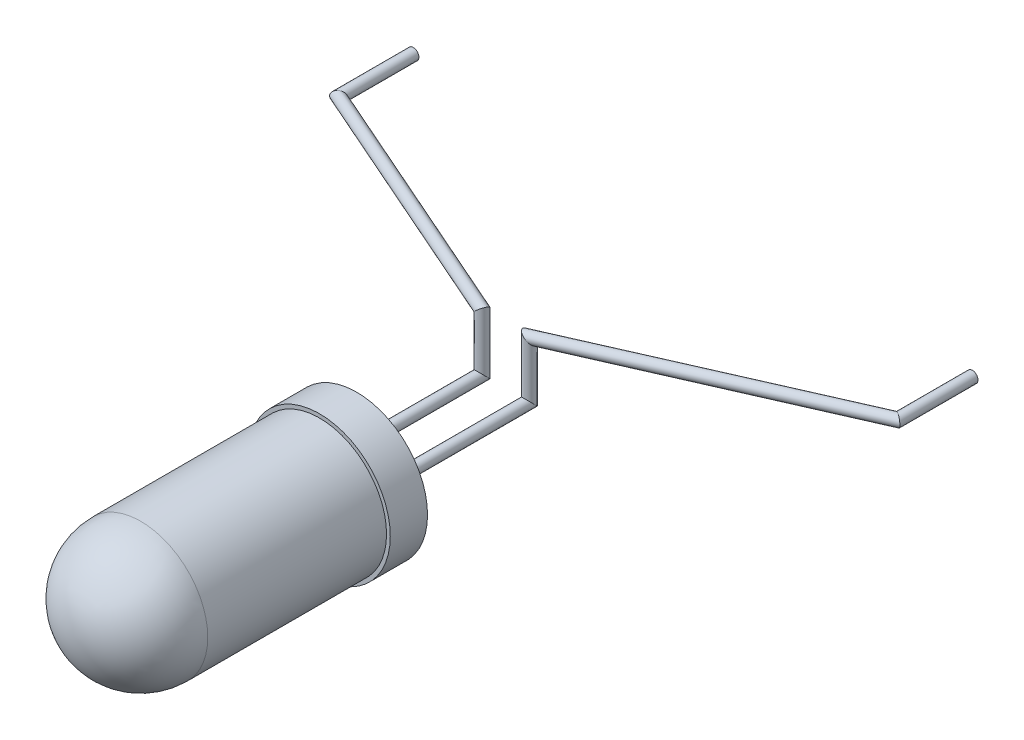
ISO-10303-21;
HEADER;
FILE_DESCRIPTION(('STEP AP214'),'2;1');
FILE_NAME('part.step','',(''),(''),'','','');
FILE_SCHEMA(('AUTOMOTIVE_DESIGN { 1 0 10303 214 1 1 1 1 }'));
ENDSEC;
DATA;
#1=APPLICATION_CONTEXT('core data for automotive mechanical design processes');
#2=APPLICATION_PROTOCOL_DEFINITION('international standard','automotive_design',2000,#1);
#3=PRODUCT_CONTEXT('',#1,'mechanical');
#4=PRODUCT('Part','Part','',(#3));
#5=PRODUCT_RELATED_PRODUCT_CATEGORY('part','',(#4));
#6=PRODUCT_DEFINITION_FORMATION('','',#4);
#7=PRODUCT_DEFINITION_CONTEXT('part definition',#1,'design');
#8=PRODUCT_DEFINITION('design','',#6,#7);
#9=PRODUCT_DEFINITION_SHAPE('','',#8);
#10=(LENGTH_UNIT() NAMED_UNIT(*) SI_UNIT(.MILLI.,.METRE.));
#11=(NAMED_UNIT(*) PLANE_ANGLE_UNIT() SI_UNIT($,.RADIAN.));
#12=(NAMED_UNIT(*) SI_UNIT($,.STERADIAN.) SOLID_ANGLE_UNIT());
#13=UNCERTAINTY_MEASURE_WITH_UNIT(LENGTH_MEASURE(1.E-05),#10,'distance_accuracy_value','');
#14=(GEOMETRIC_REPRESENTATION_CONTEXT(3) GLOBAL_UNCERTAINTY_ASSIGNED_CONTEXT((#13)) GLOBAL_UNIT_ASSIGNED_CONTEXT((#10,
#11,#12)) REPRESENTATION_CONTEXT('',''));
#15=CARTESIAN_POINT('',(0.,0.,0.));
#16=DIRECTION('',(0.,0.,1.));
#17=DIRECTION('',(1.,0.,0.));
#18=AXIS2_PLACEMENT_3D('',#15,#16,#17);
#19=CARTESIAN_POINT('',(0.,0.,0.));
#20=DIRECTION('',(0.,0.,1.));
#21=DIRECTION('',(1.,0.,0.));
#22=AXIS2_PLACEMENT_3D('',#19,#20,#21);
#23=PLANE('',#22);
#24=CARTESIAN_POINT('',(-0.635,0.,0.));
#25=DIRECTION('',(0.,0.,1.));
#26=DIRECTION('',(-1.,0.,0.));
#27=AXIS2_PLACEMENT_3D('',#24,#25,#26);
#28=CIRCLE('',#27,0.15);
#29=CARTESIAN_POINT('',(-0.785,0.,0.));
#30=VERTEX_POINT('',#29);
#31=EDGE_CURVE('E69',#30,#30,#28,.T.);
#32=ORIENTED_EDGE('',*,*,#31,.T.);
#33=EDGE_LOOP('',(#32));
#34=FACE_BOUND('',#33,.T.);
#35=CARTESIAN_POINT('',(0.,0.,0.));
#36=DIRECTION('',(0.,0.,1.));
#37=DIRECTION('',(1.,0.,0.));
#38=AXIS2_PLACEMENT_3D('',#35,#36,#37);
#39=CIRCLE('',#38,1.9);
#40=CARTESIAN_POINT('',(1.9,0.,0.));
#41=VERTEX_POINT('',#40);
#42=EDGE_CURVE('E33',#41,#41,#39,.T.);
#43=ORIENTED_EDGE('',*,*,#42,.F.);
#44=EDGE_LOOP('',(#43));
#45=FACE_BOUND('',#44,.T.);
#46=CARTESIAN_POINT('',(0.635,0.,0.));
#47=DIRECTION('',(0.,0.,1.));
#48=DIRECTION('',(1.,0.,0.));
#49=AXIS2_PLACEMENT_3D('',#46,#47,#48);
#50=CIRCLE('',#49,0.15);
#51=CARTESIAN_POINT('',(0.785,0.,0.));
#52=VERTEX_POINT('',#51);
#53=EDGE_CURVE('E10',#52,#52,#50,.F.);
#54=ORIENTED_EDGE('',*,*,#53,.F.);
#55=EDGE_LOOP('',(#54));
#56=FACE_BOUND('',#55,.T.);
#57=ADVANCED_FACE('F22',(#34,#45,#56),#23,.F.);
#58=CARTESIAN_POINT('',(0.,0.,1.));
#59=DIRECTION('',(0.,0.,1.));
#60=DIRECTION('',(1.,0.,0.));
#61=AXIS2_PLACEMENT_3D('',#58,#59,#60);
#62=PLANE('',#61);
#63=CARTESIAN_POINT('',(0.,0.,1.));
#64=DIRECTION('',(0.,0.,1.));
#65=DIRECTION('',(1.,0.,0.));
#66=AXIS2_PLACEMENT_3D('',#63,#64,#65);
#67=CIRCLE('',#66,1.9);
#68=CARTESIAN_POINT('',(1.9,0.,1.));
#69=VERTEX_POINT('',#68);
#70=EDGE_CURVE('E29',#69,#69,#67,.T.);
#71=ORIENTED_EDGE('',*,*,#70,.T.);
#72=EDGE_LOOP('',(#71));
#73=FACE_BOUND('',#72,.T.);
#74=CARTESIAN_POINT('',(0.,0.,1.));
#75=DIRECTION('',(0.,0.,1.));
#76=DIRECTION('',(1.,0.,0.));
#77=AXIS2_PLACEMENT_3D('',#74,#75,#76);
#78=CIRCLE('',#77,1.8);
#79=CARTESIAN_POINT('',(1.8,0.,1.));
#80=VERTEX_POINT('',#79);
#81=EDGE_CURVE('E42',#80,#80,#78,.T.);
#82=ORIENTED_EDGE('',*,*,#81,.F.);
#83=EDGE_LOOP('',(#82));
#84=FACE_BOUND('',#83,.T.);
#85=ADVANCED_FACE('F106',(#73,#84),#62,.T.);
#86=CARTESIAN_POINT('',(0.,0.,1.));
#87=DIRECTION('',(0.,0.,-1.));
#88=DIRECTION('',(-1.,0.,0.));
#89=AXIS2_PLACEMENT_3D('',#86,#87,#88);
#90=CYLINDRICAL_SURFACE('',#89,1.9);
#91=ORIENTED_EDGE('',*,*,#70,.F.);
#92=EDGE_LOOP('',(#91));
#93=FACE_BOUND('',#92,.T.);
#94=ORIENTED_EDGE('',*,*,#42,.T.);
#95=EDGE_LOOP('',(#94));
#96=FACE_BOUND('',#95,.T.);
#97=ADVANCED_FACE('F111',(#93,#96),#90,.T.);
#98=CARTESIAN_POINT('',(0.,0.,5.8));
#99=DIRECTION('',(0.,0.,-1.));
#100=DIRECTION('',(-1.,0.,0.));
#101=AXIS2_PLACEMENT_3D('',#98,#99,#100);
#102=CYLINDRICAL_SURFACE('',#101,1.8);
#103=CARTESIAN_POINT('',(0.,0.,5.8));
#104=DIRECTION('',(0.,0.,1.));
#105=DIRECTION('',(1.,0.,0.));
#106=AXIS2_PLACEMENT_3D('',#103,#104,#105);
#107=CIRCLE('',#106,1.8);
#108=CARTESIAN_POINT('',(1.8,0.,5.8));
#109=VERTEX_POINT('',#108);
#110=EDGE_CURVE('E37',#109,#109,#107,.T.);
#111=ORIENTED_EDGE('',*,*,#110,.F.);
#112=EDGE_LOOP('',(#111));
#113=FACE_BOUND('',#112,.T.);
#114=ORIENTED_EDGE('',*,*,#81,.T.);
#115=EDGE_LOOP('',(#114));
#116=FACE_BOUND('',#115,.T.);
#117=ADVANCED_FACE('F114',(#113,#116),#102,.T.);
#118=CARTESIAN_POINT('',(0.,0.,5.8));
#119=DIRECTION('',(0.,0.,1.));
#120=DIRECTION('',(1.,0.,0.));
#121=AXIS2_PLACEMENT_3D('',#118,#119,#120);
#122=SPHERICAL_SURFACE('',#121,1.8);
#123=ORIENTED_EDGE('',*,*,#110,.T.);
#124=EDGE_LOOP('',(#123));
#125=FACE_BOUND('',#124,.T.);
#126=ADVANCED_FACE('F24',(#125),#122,.T.);
#127=CARTESIAN_POINT('',(7.505,1.49999999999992,-7.02321731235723));
#128=DIRECTION('',(0.,0.,-1.));
#129=DIRECTION('',(0.,1.,0.));
#130=AXIS2_PLACEMENT_3D('',#127,#128,#129);
#131=CYLINDRICAL_SURFACE('',#130,0.15);
#132=CARTESIAN_POINT('',(7.505,1.49999999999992,-7.02321731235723));
#133=DIRECTION('',(0.546449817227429,0.,-0.837491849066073));
#134=DIRECTION('',(0.837491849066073,0.,0.546449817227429));
#135=AXIS2_PLACEMENT_3D('',#132,#133,#134);
#136=ELLIPSE('',#135,0.179106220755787,0.15);
#137=CARTESIAN_POINT('',(7.655,1.49999999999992,-6.92534475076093));
#138=VERTEX_POINT('',#137);
#139=EDGE_CURVE('E48',#138,#138,#136,.T.);
#140=ORIENTED_EDGE('',*,*,#139,.T.);
#141=EDGE_LOOP('',(#140));
#142=FACE_BOUND('',#141,.T.);
#143=CARTESIAN_POINT('',(7.505,1.49999999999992,-9.02321731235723));
#144=DIRECTION('',(0.,0.,-1.));
#145=DIRECTION('',(0.,1.,0.));
#146=AXIS2_PLACEMENT_3D('',#143,#144,#145);
#147=CIRCLE('',#146,0.15);
#148=CARTESIAN_POINT('',(7.505,1.64999999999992,-9.02321731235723));
#149=VERTEX_POINT('',#148);
#150=EDGE_CURVE('E45',#149,#149,#147,.F.);
#151=ORIENTED_EDGE('',*,*,#150,.T.);
#152=EDGE_LOOP('',(#151));
#153=FACE_BOUND('',#152,.T.);
#154=ADVANCED_FACE('F128',(#142,#153),#131,.T.);
#155=CARTESIAN_POINT('',(0.635000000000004,1.5,-4.));
#156=DIRECTION('',(0.915294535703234,0.,-0.402785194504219));
#157=DIRECTION('',(-0.402785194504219,0.,-0.915294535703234));
#158=AXIS2_PLACEMENT_3D('',#155,#156,#157);
#159=CYLINDRICAL_SURFACE('',#158,0.15);
#160=CARTESIAN_POINT('',(0.635000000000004,1.5,-4.));
#161=DIRECTION('',(0.647210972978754,0.707106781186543,-0.284812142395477));
#162=DIRECTION('',(-0.647210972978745,0.707106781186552,0.284812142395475));
#163=AXIS2_PLACEMENT_3D('',#160,#161,#162);
#164=ELLIPSE('',#163,0.212132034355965,0.15);
#165=CARTESIAN_POINT('',(0.497705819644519,1.65,-3.93958222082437));
#166=VERTEX_POINT('',#165);
#167=EDGE_CURVE('E51',#166,#166,#164,.F.);
#168=ORIENTED_EDGE('',*,*,#167,.F.);
#169=EDGE_LOOP('',(#168));
#170=FACE_BOUND('',#169,.T.);
#171=ORIENTED_EDGE('',*,*,#139,.F.);
#172=EDGE_LOOP('',(#171));
#173=FACE_BOUND('',#172,.T.);
#174=ADVANCED_FACE('F137',(#170,#173),#159,.T.);
#175=CARTESIAN_POINT('',(0.635,0.,-4.));
#176=DIRECTION('',(0.,1.,0.));
#177=DIRECTION('',(-1.,0.,0.));
#178=AXIS2_PLACEMENT_3D('',#175,#176,#177);
#179=CYLINDRICAL_SURFACE('',#178,0.15);
#180=CARTESIAN_POINT('',(0.635,0.,-4.));
#181=DIRECTION('',(0.,0.707106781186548,-0.707106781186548));
#182=DIRECTION('',(0.,0.707106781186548,0.707106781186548));
#183=AXIS2_PLACEMENT_3D('',#180,#181,#182);
#184=ELLIPSE('',#183,0.212132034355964,0.15);
#185=CARTESIAN_POINT('',(0.635,0.15,-3.85));
#186=VERTEX_POINT('',#185);
#187=EDGE_CURVE('E54',#186,#186,#184,.T.);
#188=ORIENTED_EDGE('',*,*,#187,.T.);
#189=EDGE_LOOP('',(#188));
#190=FACE_BOUND('',#189,.T.);
#191=ORIENTED_EDGE('',*,*,#167,.T.);
#192=EDGE_LOOP('',(#191));
#193=FACE_BOUND('',#192,.T.);
#194=ADVANCED_FACE('F142',(#190,#193),#179,.T.);
#195=CARTESIAN_POINT('',(0.635,0.,-4.42426406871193));
#196=DIRECTION('',(0.,0.,1.));
#197=DIRECTION('',(1.,0.,0.));
#198=AXIS2_PLACEMENT_3D('',#195,#196,#197);
#199=CYLINDRICAL_SURFACE('',#198,0.15);
#200=ORIENTED_EDGE('',*,*,#53,.T.);
#201=EDGE_LOOP('',(#200));
#202=FACE_BOUND('',#201,.T.);
#203=ORIENTED_EDGE('',*,*,#187,.F.);
#204=EDGE_LOOP('',(#203));
#205=FACE_BOUND('',#204,.T.);
#206=ADVANCED_FACE('F149',(#202,#205),#199,.T.);
#207=CARTESIAN_POINT('',(7.505,1.49999999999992,-9.02321731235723));
#208=DIRECTION('',(0.,0.,-1.));
#209=DIRECTION('',(0.,1.,0.));
#210=AXIS2_PLACEMENT_3D('',#207,#208,#209);
#211=PLANE('',#210);
#212=ORIENTED_EDGE('',*,*,#150,.F.);
#213=EDGE_LOOP('',(#212));
#214=FACE_BOUND('',#213,.T.);
#215=ADVANCED_FACE('F97',(#214),#211,.T.);
#216=CARTESIAN_POINT('',(-7.505,1.49999999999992,-7.02321731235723));
#217=DIRECTION('',(0.,0.,-1.));
#218=DIRECTION('',(0.,1.,0.));
#219=AXIS2_PLACEMENT_3D('',#216,#217,#218);
#220=CYLINDRICAL_SURFACE('',#219,0.15);
#221=CARTESIAN_POINT('',(-7.505,1.49999999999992,-7.02321731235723));
#222=DIRECTION('',(-0.546449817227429,0.,-0.837491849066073));
#223=DIRECTION('',(-0.837491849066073,0.,0.546449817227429));
#224=AXIS2_PLACEMENT_3D('',#221,#222,#223);
#225=ELLIPSE('',#224,0.179106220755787,0.15);
#226=CARTESIAN_POINT('',(-7.655,1.49999999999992,-6.92534475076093));
#227=VERTEX_POINT('',#226);
#228=EDGE_CURVE('E60',#227,#227,#225,.F.);
#229=ORIENTED_EDGE('',*,*,#228,.F.);
#230=EDGE_LOOP('',(#229));
#231=FACE_BOUND('',#230,.T.);
#232=CARTESIAN_POINT('',(-7.505,1.49999999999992,-9.02321731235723));
#233=DIRECTION('',(0.,0.,-1.));
#234=DIRECTION('',(0.,1.,0.));
#235=AXIS2_PLACEMENT_3D('',#232,#233,#234);
#236=CIRCLE('',#235,0.15);
#237=CARTESIAN_POINT('',(-7.505,1.64999999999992,-9.02321731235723));
#238=VERTEX_POINT('',#237);
#239=EDGE_CURVE('E57',#238,#238,#236,.T.);
#240=ORIENTED_EDGE('',*,*,#239,.F.);
#241=EDGE_LOOP('',(#240));
#242=FACE_BOUND('',#241,.T.);
#243=ADVANCED_FACE('F91',(#231,#242),#220,.T.);
#244=CARTESIAN_POINT('',(-0.635000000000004,1.5,-4.));
#245=DIRECTION('',(-0.915294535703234,0.,-0.402785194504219));
#246=DIRECTION('',(-0.402785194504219,0.,0.915294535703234));
#247=AXIS2_PLACEMENT_3D('',#244,#245,#246);
#248=CYLINDRICAL_SURFACE('',#247,0.15);
#249=CARTESIAN_POINT('',(-0.635000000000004,1.5,-4.));
#250=DIRECTION('',(-0.647210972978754,0.707106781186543,-0.284812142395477));
#251=DIRECTION('',(0.647210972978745,0.707106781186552,0.284812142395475));
#252=AXIS2_PLACEMENT_3D('',#249,#250,#251);
#253=ELLIPSE('',#252,0.212132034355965,0.15);
#254=CARTESIAN_POINT('',(-0.497705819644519,1.65,-3.93958222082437));
#255=VERTEX_POINT('',#254);
#256=EDGE_CURVE('E63',#255,#255,#253,.T.);
#257=ORIENTED_EDGE('',*,*,#256,.T.);
#258=EDGE_LOOP('',(#257));
#259=FACE_BOUND('',#258,.T.);
#260=ORIENTED_EDGE('',*,*,#228,.T.);
#261=EDGE_LOOP('',(#260));
#262=FACE_BOUND('',#261,.T.);
#263=ADVANCED_FACE('F85',(#259,#262),#248,.T.);
#264=CARTESIAN_POINT('',(-0.635,0.,-4.));
#265=DIRECTION('',(0.,1.,0.));
#266=DIRECTION('',(-1.,0.,0.));
#267=AXIS2_PLACEMENT_3D('',#264,#265,#266);
#268=CYLINDRICAL_SURFACE('',#267,0.15);
#269=CARTESIAN_POINT('',(-0.635,0.,-4.));
#270=DIRECTION('',(0.,0.707106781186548,-0.707106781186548));
#271=DIRECTION('',(0.,0.707106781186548,0.707106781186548));
#272=AXIS2_PLACEMENT_3D('',#269,#270,#271);
#273=ELLIPSE('',#272,0.212132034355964,0.15);
#274=CARTESIAN_POINT('',(-0.635,0.15,-3.85));
#275=VERTEX_POINT('',#274);
#276=EDGE_CURVE('E66',#275,#275,#273,.F.);
#277=ORIENTED_EDGE('',*,*,#276,.F.);
#278=EDGE_LOOP('',(#277));
#279=FACE_BOUND('',#278,.T.);
#280=ORIENTED_EDGE('',*,*,#256,.F.);
#281=EDGE_LOOP('',(#280));
#282=FACE_BOUND('',#281,.T.);
#283=ADVANCED_FACE('F79',(#279,#282),#268,.T.);
#284=CARTESIAN_POINT('',(-0.635,0.,-4.42426406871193));
#285=DIRECTION('',(0.,0.,1.));
#286=DIRECTION('',(1.,0.,0.));
#287=AXIS2_PLACEMENT_3D('',#284,#285,#286);
#288=CYLINDRICAL_SURFACE('',#287,0.15);
#289=ORIENTED_EDGE('',*,*,#31,.F.);
#290=EDGE_LOOP('',(#289));
#291=FACE_BOUND('',#290,.T.);
#292=ORIENTED_EDGE('',*,*,#276,.T.);
#293=EDGE_LOOP('',(#292));
#294=FACE_BOUND('',#293,.T.);
#295=ADVANCED_FACE('F75',(#291,#294),#288,.T.);
#296=CARTESIAN_POINT('',(-7.505,1.49999999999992,-9.02321731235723));
#297=DIRECTION('',(0.,0.,-1.));
#298=DIRECTION('',(0.,1.,0.));
#299=AXIS2_PLACEMENT_3D('',#296,#297,#298);
#300=PLANE('',#299);
#301=ORIENTED_EDGE('',*,*,#239,.T.);
#302=EDGE_LOOP('',(#301));
#303=FACE_BOUND('',#302,.T.);
#304=ADVANCED_FACE('F78',(#303),#300,.T.);
#305=CLOSED_SHELL('',(#57,#85,#97,#117,#126,#154,#174,#194,#206,#215,#243,#263,#283,#295,#304));
#306=MANIFOLD_SOLID_BREP('B2',#305);
#307=ADVANCED_BREP_SHAPE_REPRESENTATION('',(#18,#306),#14);
#308=SHAPE_DEFINITION_REPRESENTATION(#9,#307);
ENDSEC;
END-ISO-10303-21;
